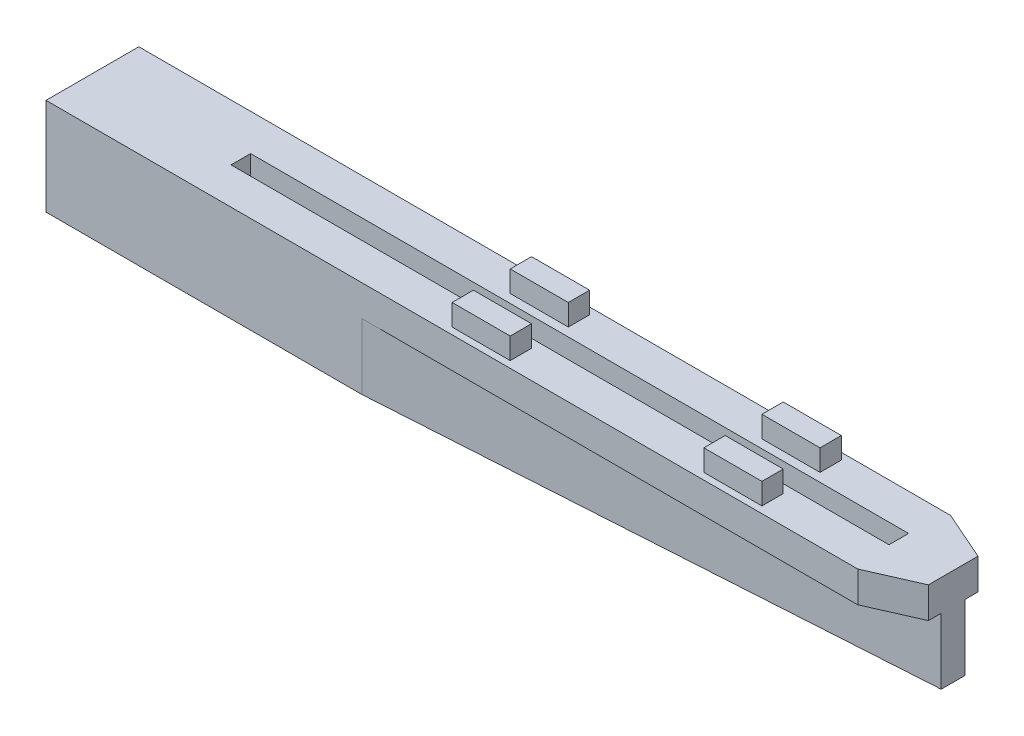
from build123d import *

# Parameters (mm, degrees)
BOSS_EXTRUDE1_DEPTH = 5
SKETCH2_W           = 169.901358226
SKETCH2_H           = 5.057880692
CUT_EXTRUDE1_DEPTH  = 26
SKETCH3_W           = 15
SKETCH3_H           = 5.5
BOSS_EXTRUDE2_DEPTH = 5.5
SKETCH4_W           = 169.901358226
SKETCH4_H           = 5.057880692
BOSS_EXTRUDE3_DEPTH = 20
CUT_EXTRUDE5_DEPTH  = 17


with BuildPart() as part:
    # Sketch1 → Boss-Extrude1 (new body)
    with BuildSketch(Plane(origin=(0, 0, 0), x_dir=(1, 0, 0), z_dir=(0, 1, 0))):
        Polygon((-69.180780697, 17.519952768), (140.433207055, 17.519952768), (153.094163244, 11.942432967), (153.094163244, -0.867190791), (140.433207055, -6.444710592), (-69.180780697, -6.444710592), align=None)
    extrude(amount=BOSS_EXTRUDE1_DEPTH)

    # Sketch2 → Cut-Extrude1 (cut)
    with BuildSketch(Plane.XZ):
        with Locations((54.091074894, -5.537621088)):
            Rectangle(SKETCH2_W, SKETCH2_H)
    extrude(amount=-CUT_EXTRUDE1_DEPTH, mode=Mode.SUBTRACT)

    # Sketch3 → Boss-Extrude2 (add)
    with BuildSketch(Plane(origin=(0, 5, 0), x_dir=(1, 0, 0), z_dir=(0, 1, 0))):
        with Locations((106.456138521, 13.037621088)):
            Rectangle(SKETCH3_W, SKETCH3_H)
        with Locations((106.456138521, -1.962378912)):
            Rectangle(SKETCH3_W, SKETCH3_H)
        with Locations((41.456138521, -1.962378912)):
            Rectangle(SKETCH3_W, SKETCH3_H)
        with Locations((41.456138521, 13.037621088)):
            Rectangle(SKETCH3_W, SKETCH3_H)
    extrude(amount=BOSS_EXTRUDE2_DEPTH)

    # Sketch4 → Boss-Extrude3 (add)
    with BuildSketch(Plane.XZ):
        Polygon((-69.180780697, 6.444710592), (-69.180780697, -17.519952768), (140.433207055, -17.519952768), (153.094163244, -11.942432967), (153.094163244, 0.867190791), (140.433207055, 6.444710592), align=None)
        with Locations((54.091074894, -5.537621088)):
            Rectangle(SKETCH4_W, SKETCH4_H, mode=Mode.SUBTRACT)
    extrude(amount=BOSS_EXTRUDE3_DEPTH)

    # Sketch7 → Cut-Extrude5 (cut)
    with BuildSketch(Plane.XZ.offset(20)):
        Polygon((12.387057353, -17.519952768), (140.433207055, -17.519952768), (153.094163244, -11.942432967), (153.094163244, -8.637621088), align=None)
        Polygon((153.094163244, -2.437621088), (153.094163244, 0.867190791), (140.433207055, 6.444710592), (12.387057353, 6.444710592), align=None)
    extrude(amount=-CUT_EXTRUDE5_DEPTH, mode=Mode.SUBTRACT)


solid = part.part
